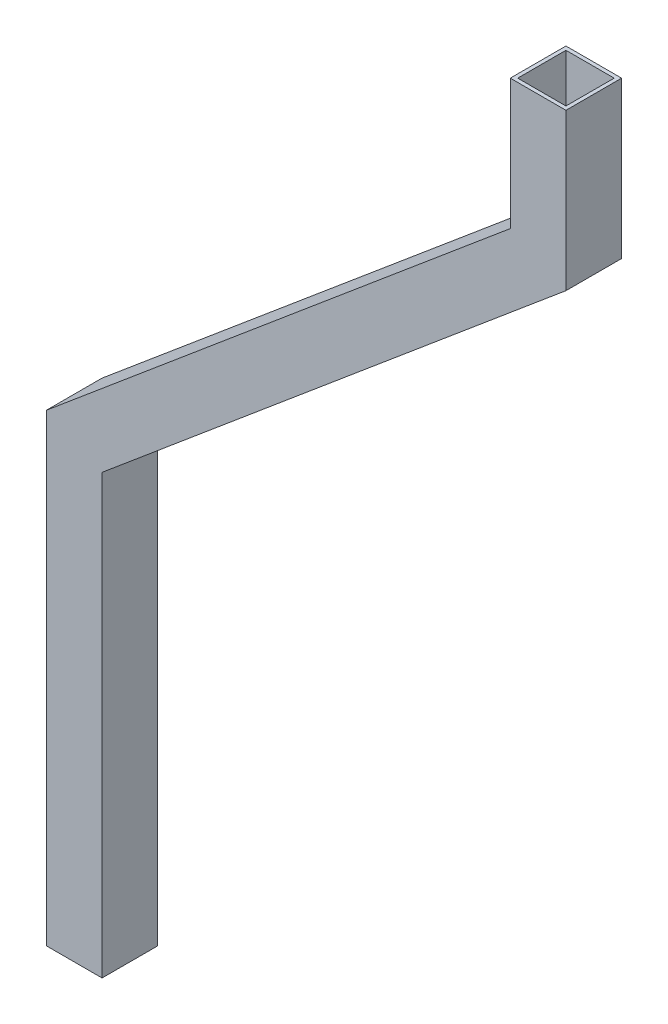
from build123d import *

# Parameters (mm, degrees)
SCHIZZO3_W   = 30
SCHIZZO3_H   = 30
SCHIZZO3_W_2 = 26
SCHIZZO3_H_2 = 26


with BuildPart() as part:
    # Sweep-Sottile1: sweep along a path in Schizzo1
    with BuildLine(Plane.XY) as sweep_sottile1_path:
        Line((0, 0), (0, 250))
        Line((0, 250), (250, 459.774907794))
        Line((250, 459.774907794), (250, 530))
    # Schizzo3 → Sweep-Sottile1 (sweep)
    with BuildSketch(Plane(origin=(0, 0, 0), x_dir=(1, 0, 0), z_dir=(0, 1, 0))):
        with Locations((15, -15)):
            Rectangle(SCHIZZO3_W, SCHIZZO3_H)
        with Locations((15, -15)):
            Rectangle(SCHIZZO3_W_2, SCHIZZO3_H_2, mode=Mode.SUBTRACT)
    sweep(path=sweep_sottile1_path.line, transition=Transition.RIGHT)


solid = part.part
